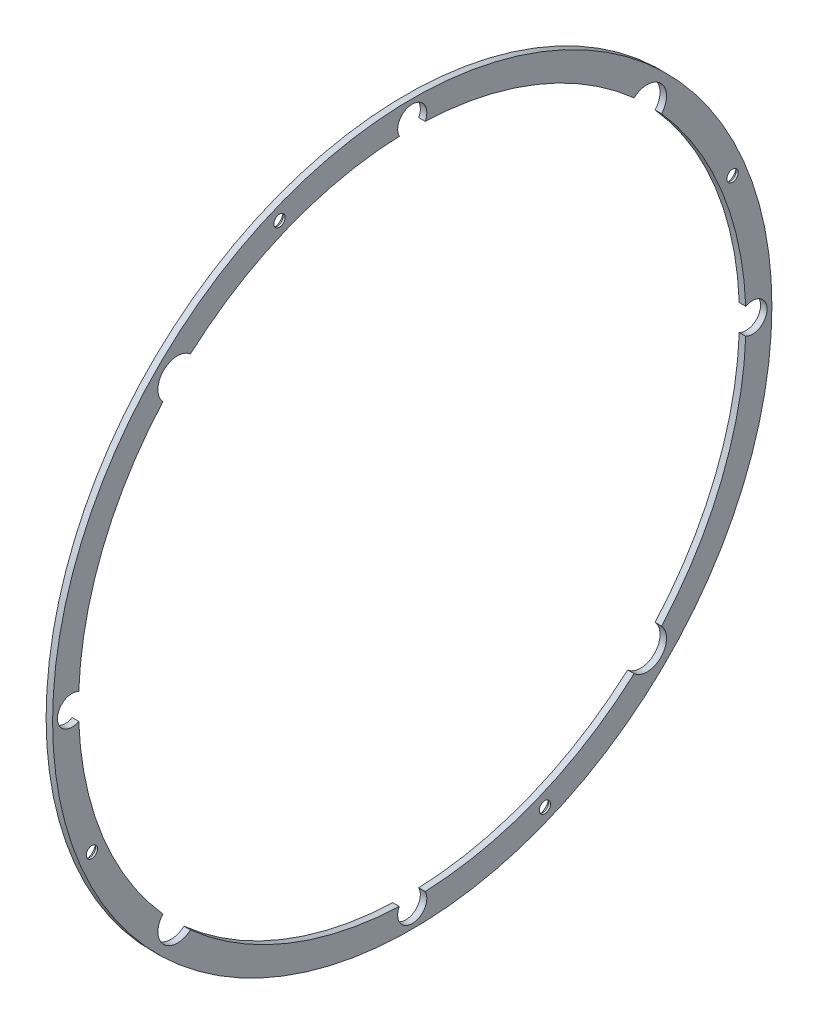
from build123d import *

# Parameters (mm, degrees)
SKETCH_1_W               = 2
SKETCH_1_H               = 111
SKETCH_2_R               = 103
CUT_EXTRUDE_1_DEPTH      = 157.990445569
SKETCH_3_R               = 4.5
CUT_EXTRUDE_2_DEPTH      = 157.990445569
PATTERN_CIRCULAR_1_COUNT = 4
SKETCH_4_R               = 6
CUT_EXTRUDE_3_DEPTH      = 157.990445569
PATTERN_CIRCULAR_2_COUNT = 4
PATTERN_CIRCULAR_3_COUNT = 4


with BuildPart() as part:
    # Sketch 1 → Revolve 1 (revolve)
    with BuildSketch(Plane.XY, mode=Mode.PRIVATE) as revolve_1_sk:
        with Locations((1, 55.5)):
            Rectangle(SKETCH_1_W, SKETCH_1_H)
    revolve(revolve_1_sk.sketch.rotate(Axis((0, 0, 0), (1, 0, 0)), 90), axis=Axis((0, 0, 0), (1, 0, 0)))

    # Sketch 2 → Cut-Extrude 1 (cut, through all)
    with BuildSketch(Plane(origin=(2, 0, 0), x_dir=(0, 0, -1), z_dir=(1, 0, 0))):
        Circle(SKETCH_2_R)
    extrude(amount=-CUT_EXTRUDE_1_DEPTH, mode=Mode.SUBTRACT)

    # Sketch 3 → Cut-Extrude 2 (cut, through all)
    with BuildSketch(Plane.ZY):
        with Locations((-105, 0)):
            Circle(SKETCH_3_R)
    cut_extrude_2 = extrude(amount=-CUT_EXTRUDE_2_DEPTH, mode=Mode.SUBTRACT)

    # Pattern Circular 1: Cut-Extrude 2 ×4 about axis
    pattern_circular_1_axis = Axis((0, 0, 0), (1, 0, 0))
    for i in range(1, PATTERN_CIRCULAR_1_COUNT):
        add(cut_extrude_2.rotate(pattern_circular_1_axis, i * 360 / PATTERN_CIRCULAR_1_COUNT), mode=Mode.SUBTRACT)

    # Sketch 4 → Cut-Extrude 3 (cut, through all)
    with BuildSketch(Plane.ZY):
        with Locations((-72.478445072, 72.478445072)):
            Circle(SKETCH_4_R)
    cut_extrude_3 = extrude(amount=-CUT_EXTRUDE_3_DEPTH, mode=Mode.SUBTRACT)

    # Pattern Circular 2: Cut-Extrude 3 ×4 about axis
    pattern_circular_2_axis = Axis((0, 0, 0), (1, 0, 0))
    for i in range(1, PATTERN_CIRCULAR_2_COUNT):
        add(cut_extrude_3.rotate(pattern_circular_2_axis, i * 360 / PATTERN_CIRCULAR_2_COUNT), mode=Mode.SUBTRACT)

    # Sketch 6 → Hole Wizard M31 (revolve, cut)
    with BuildSketch(Plane(origin=(0, 40.947127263, -98.855109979), x_dir=(0, 0, 1), z_dir=(0, 1, 0))):
        Polygon((0, 0), (0, 2), (1.75, 2), (1.75, 1.35), (3.1, 0), align=None)
    hole_wizard_m31 = revolve(axis=Axis((-6.35, 40.947127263, -98.855109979), (1, 0, 0)), mode=Mode.SUBTRACT)

    # Pattern Circular 3: Hole Wizard M31 ×4 about axis
    pattern_circular_3_axis = Axis((0, 0, 0), (1, 0, 0))
    for i in range(1, PATTERN_CIRCULAR_3_COUNT):
        add(hole_wizard_m31.rotate(pattern_circular_3_axis, i * 360 / PATTERN_CIRCULAR_3_COUNT), mode=Mode.SUBTRACT)


solid = part.part
